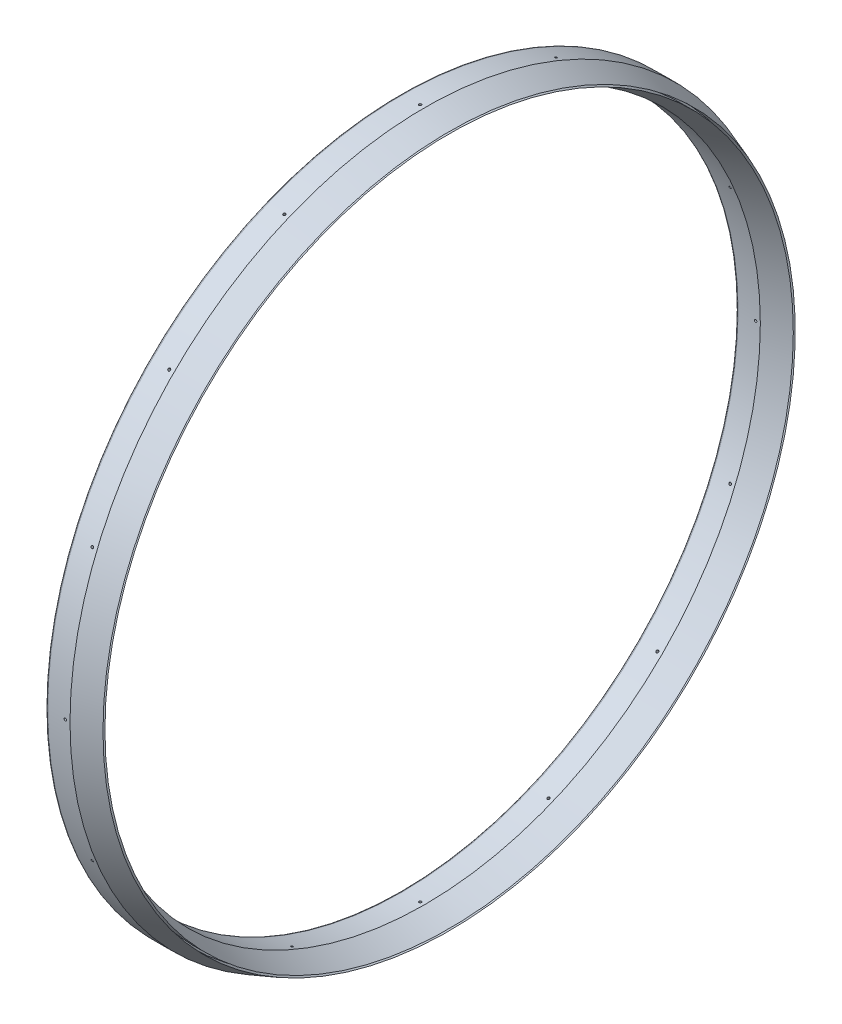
from build123d import *

# Parameters (mm, degrees)
SKETCH2_R          = 1.1303
CUT_EXTRUDE1_DEPTH = 12.7
SKETCH6_R          = 0.635
CUT_EXTRUDE3_DEPTH = 300
CIRPATTERN7_COUNT  = 16
CIRPATTERN8_COUNT  = 16
FILLET1_R          = 1


with BuildPart() as part:
    # Sketch1 → Revolve1 (revolve)
    with BuildSketch(Plane.XY, mode=Mode.PRIVATE) as revolve1_sk:
        Polygon((-12.4, 171.9), (-12.4, 181.9), (0, 181.9), (12.4, 177.4), (6, 177.4), (6, 176.4), (12.4, 176.4), (0, 171.9), align=None)
    revolve(revolve1_sk.sketch.rotate(Axis((-102.621263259, 0, 0), (1, 0, 0)), 90), axis=Axis((-102.621263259, 0, 0), (1, 0, 0)))

    # Sketch2 → Cut-Extrude1 (cut)
    with BuildSketch(Plane.ZY.offset(12.4)):
        with Locations((0, 176.9)):
            Circle(SKETCH2_R)
    extrude(amount=-CUT_EXTRUDE1_DEPTH, mode=Mode.SUBTRACT)

    # Sketch5 → M5x0.8 Tapped Hole1 (revolve, cut)
    with BuildSketch(Plane(origin=(-12.4, 176.9, 0), x_dir=(0, 0, 1), z_dir=(0, 1, 0))):
        Polygon((0, 0), (0, 11.6618073), (2.1, 10.4), (2.1, 0), align=None)
    m5x0_8_tapped_hole1 = revolve(axis=Axis((-18.75, 176.9, 0), (1, 0, 0)), mode=Mode.SUBTRACT)

    # Sketch6 → Cut-Extrude3 (cut)
    with BuildSketch(Plane(origin=(0, 0, 0), x_dir=(1, 0, 0), z_dir=(0, 1, 0))):
        with Locations(Location((-2.412220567, 0, 0), (0, 0, 270))):
            Circle(SKETCH6_R)
    cut_extrude3 = extrude(amount=-CUT_EXTRUDE3_DEPTH, mode=Mode.SUBTRACT)

    # CirPattern7: Cut-Extrude3 ×16 about axis
    cirpattern7_axis = Axis((-102.621263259, 0, 0), (-1, 0, 0))
    for i in range(1, CIRPATTERN7_COUNT):
        add(cut_extrude3.rotate(cirpattern7_axis, i * 360 / CIRPATTERN7_COUNT), mode=Mode.SUBTRACT)

    # CirPattern8: M5x0.8 Tapped Hole1 ×16 about axis
    cirpattern8_axis = Axis((0, 0, 0), (1, 0, 0))
    for i in range(1, CIRPATTERN8_COUNT):
        add(m5x0_8_tapped_hole1.rotate(cirpattern8_axis, i * 360 / CIRPATTERN8_COUNT), mode=Mode.SUBTRACT)

    # Fillet1
    fillet1_edges = [part.edges().sort_by_distance(p)[0] for p in [
        (-12.4, 0, -171.9),
        (-12.4, 0, -181.9),
    ]]
    fillet(fillet1_edges, radius=FILLET1_R)


solid = part.part
